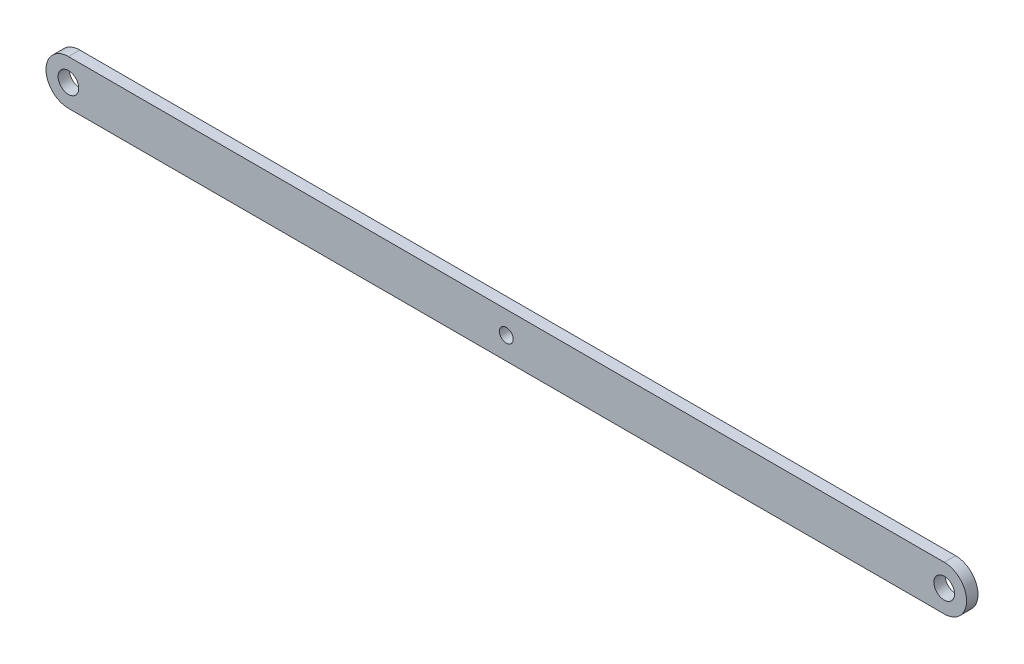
from build123d import *

# Parameters (mm, degrees)
ESQUISSE1_R        = 3
ESQUISSE1_R_2      = 2
BOSS_EXTRU_1_DEPTH = 3.3


with BuildPart() as part:
    # Esquisse1 → Boss.-Extru.1 (new body)
    with BuildSketch(Plane.XY):
        with BuildLine():
            Line((0, 6.5), (254, 6.5))
            ThreePointArc((254, 6.5), (260.5, 0), (254, -6.5))
            Line((254, -6.5), (0, -6.5))
            ThreePointArc((0, -6.5), (-6.5, 0), (0, 6.5))
        make_face()
        Circle(ESQUISSE1_R, mode=Mode.SUBTRACT)
        with Locations((254, 0)):
            Circle(ESQUISSE1_R, mode=Mode.SUBTRACT)
        with Locations((127, 0)):
            Circle(ESQUISSE1_R_2, mode=Mode.SUBTRACT)
    extrude(amount=BOSS_EXTRU_1_DEPTH)


solid = part.part
